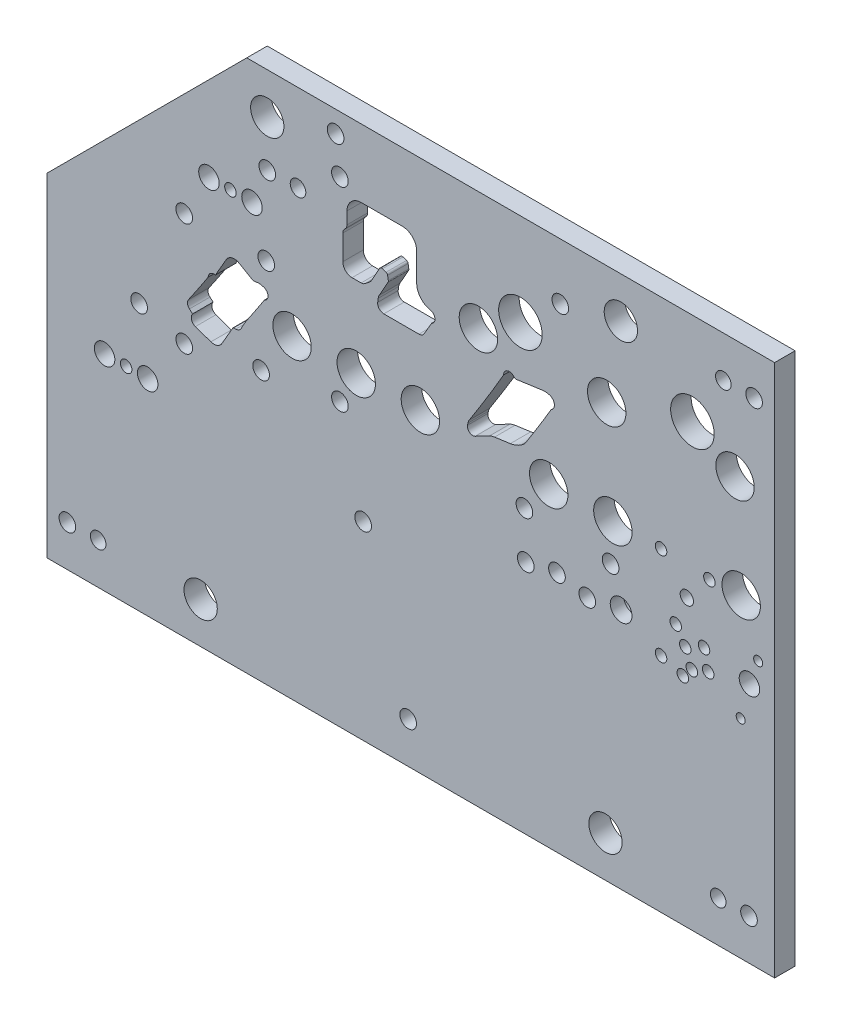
from build123d import *

# Parameters (mm, degrees)
BOSS_EXTRUDE1_DEPTH                            = 12.7
HOLE1_D                                        = 7.14375
HOLE11_D                                       = 7.14375
HOLE12_D                                       = 7.14375
HOLE13_D                                       = 8.2677
HOLE14_D                                       = 7.14375
HOLE15_D                                       = 10.31875
HOLE18_D                                       = 23.8125
HOLE19_D                                       = 26.9875
HOLE110_D                                      = 10.3124
HOLE111_D                                      = 9.652
HOLE112_D                                      = 20.6375
HOLE113_D                                      = 10.3124
HOLE114_D                                      = 10.3124
HOLE115_D                                      = 7.1374
HOLE116_D                                      = 7.1374
HOLE117_D                                      = 12.7
COPY_OF_P250520L_25X1_25_SHSB_10_24_2_D        = 7.1374
COPY_OF_P250520L_25X1_25_SHSB_10_2_2_D         = 12.7
HOLE118_D                                      = 10.3124
HOLE119_D                                      = 10.31875
CUT_EXTRUDE1_QU250515L_PUNCH1_MOUNTED_IN_DEPTH = 1211.017618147
CUT_EXTRUDE1_QU250515L_PUNCH5_MOUNTED_IN_DEPTH = 1211.017618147
CUT_EXTRUDE1_QU250515L_PUNCH4_MOUNTED_IN_DEPTH = 1211.017618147
HOLE120_D                                      = 12.7
HOLE121_D                                      = 5.6134
CUT_EXTRUDE1_DEPTH                             = 1211.017618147


with BuildPart() as part:
    # Sketch1 → Boss-Extrude1 (new body)
    with BuildSketch(Plane.XY):
        Polygon((-1196.34, -180.975), (-745.49, -180.975), (-745.49, 149.225), (-1072.515, 149.225), (-1196.34, 25.4), align=None)
    extrude(amount=BOSS_EXTRUDE1_DEPTH)

    # Hole1 (through all)
    with Locations(Plane(origin=(-798.700521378, -36.640114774, 0), x_dir=(-1, 0, 0), z_dir=(0, 0, -1))):
        with Locations((3.654260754, -10.601140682), (-1.922520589, -4.536872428)):
            Hole(HOLE1_D / 2)

    # Hole11 (through all)
    with Locations(Plane(origin=(-785.566517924, -14.952072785, 0), x_dir=(-1, 0, 0), z_dir=(0, 0, -1))):
        with Locations((3.654260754, -10.601140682)):
            Hole(HOLE11_D / 2)

    # Hole12 (through all)
    with Locations(Plane(origin=(-803.106128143, -11.084921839, 0), x_dir=(-1, 0, 0), z_dir=(0, 0, -1))):
        with Locations((3.654260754, -10.601140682)):
            Hole(HOLE12_D / 2)

    # Hole13 (through all)
    with Locations(Plane(origin=(-803.527406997, 6.49142751, 12.7), x_dir=(1, 0, 0), z_dir=(0, 0, 1))):
        with Locations((3.654260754, -10.601140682)):
            Hole(HOLE13_D / 2)

    # Hole14 (through all)
    with Locations(Plane(origin=(-804.484056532, -20.349265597, 12.7), x_dir=(1, 0, 0), z_dir=(0, 0, 1))):
        with Locations((3.654260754, -10.601140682)):
            Hole(HOLE14_D / 2)

    # Hole15 (through all)
    with Locations(Plane(origin=(-876.677535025, -20.349265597, 0), x_dir=(-1, 0, 0), z_dir=(0, 0, -1))):
        with Locations((3.654260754, -10.601140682)):
            Hole(HOLE15_D / 2)

    # Profil_Sketch7 → Hole17 (revolve, cut)
    with BuildSketch(Plane(origin=(-840.580795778, -30.950406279, 0), x_dir=(0, 1, 0), z_dir=(1, 0, 0))):
        Polygon((0, 12.7), (6.746875, 12.7), (6.746875, 4.445), (10.31875, 4.445), (10.31875, -1), (0, -1), align=None)
    revolve(axis=Axis((-840.580795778, -30.950406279, 0), (0, 0, 1)), mode=Mode.SUBTRACT)

    # Hole18 (through all)
    with Locations(Plane(origin=(-766.346739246, 86.496340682, 0), x_dir=(-1, 0, 0), z_dir=(0, 0, -1))):
        with Locations((3.654260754, -10.601140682), (83.156260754, -10.601140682), (162.658260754, -10.601140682), (278.101260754, -72.526340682), (238.350260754, -72.526340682), (198.599260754, -72.526340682), (119.097260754, -72.526340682), (-0.155739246, -72.526340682), (79.346260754, -72.526340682)):
            Hole(HOLE18_D / 2)

    # Hole19 (through all)
    with Locations(Plane(origin=(-796.896260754, 102.676140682, 12.7), x_dir=(1, 0, 0), z_dir=(0, 0, 1))):
        with Locations((0.479260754, -10.601140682), (-106.073739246, -10.601140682)):
            Hole(HOLE19_D / 2)

    # Hole110 (through all)
    with Locations(Plane(origin=(-761.844260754, 134.426140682, 12.7), x_dir=(1, 0, 0), z_dir=(0, 0, 1))):
        with Locations((3.654260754, -10.601140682), (0.479260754, -290.001140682), (-421.795739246, -290.001140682), (-297.970739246, -39.176140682), (-238.534739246, -197.926140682), (-85.245739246, -143.951140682), (-210.658239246, -290.001140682), (-377.345739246, -150.301140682)):
            Hole(HOLE110_D / 2)

    # Hole111 (through all)
    with Locations(Plane(origin=(-1160.935739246, -144.973859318, 0), x_dir=(-1, 0, 0), z_dir=(0, 0, -1))):
        with Locations((3.654260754, -10.601140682), (-120.170739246, 240.223859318), (-383.695739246, 268.798859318), (-380.520739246, -10.601140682)):
            Hole(HOLE111_D / 2)

    # Hole112 (through all)
    with Locations(Plane(origin=(-1104.744260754, -144.973859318, 12.7), x_dir=(1, 0, 0), z_dir=(0, 0, 1))):
        with Locations((3.654260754, -10.601140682), (44.929260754, 268.798859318), (264.004260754, 268.798859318), (254.479260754, -10.601140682)):
            Hole(HOLE112_D / 2)

    # Hole113 (through all)
    with Locations(Plane(origin=(-904.147760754, 10.601140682, 12.7), x_dir=(1, 0, 0), z_dir=(0, 0, 1))):
        with Locations((3.654260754, -16.951140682), (25.879260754, 103.698859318), (-110.645739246, 103.698859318), (-110.645739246, -16.951140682)):
            Hole(HOLE113_D / 2)

    # Hole114 (through all)
    with Locations(Plane(origin=(-1114.904260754, -12.893859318, 12.7), x_dir=(1, 0, 0), z_dir=(0, 0, 1))):
        with Locations((3.654260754, -10.601140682), (51.279260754, -1.076140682), (54.454260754, 59.248859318), (3.654260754, 59.248859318)):
            Hole(HOLE114_D / 2)

    # Hole115 (through all)
    with Locations(Plane(origin=(-819.502260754, 24.779469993, 12.7), x_dir=(1, 0, 0), z_dir=(0, 0, 1))):
        with Locations((3.654260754, -10.601140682), (33.626260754, -12.235458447), (32.864260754, -61.998940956), (3.654260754, -67.954634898)):
            Hole(HOLE115_D / 2)

    # Hole116 (through all)
    with Locations(Plane(origin=(-1078.957239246, 83.943640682, 0), x_dir=(-1, 0, 0), z_dir=(0, 0, -1))):
        with Locations((3.654260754, -10.601140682)):
            Hole(HOLE116_D / 2)

    # Hole117 (through all)
    with Locations(Plane(origin=(-1092.292239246, 83.943640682, 0), x_dir=(-1, 0, 0), z_dir=(0, 0, -1))):
        with Locations((3.654260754, -10.601140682), (-23.015739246, -10.601140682)):
            Hole(HOLE117_D / 2)

    # Copy of P250520L_.25x1.25-SHSB-_10-24_-2 (through all)
    with Locations(Plane(origin=(-967.260739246, -5.273859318, 0), x_dir=(-1, 0, 0), z_dir=(0, 0, -1))):
        with Locations((179.993760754, -48.383640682)):
            Hole(COPY_OF_P250520L_25X1_25_SHSB_10_24_2_D / 2)

    # Copy of P250520L_.25x1.25-SHSB-_10-2 2 (through all)
    with Locations(Plane(origin=(-980.595739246, -5.273859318, 0), x_dir=(-1, 0, 0), z_dir=(0, 0, -1))):
        with Locations((179.993760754, -48.383640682), (153.323760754, -48.383640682)):
            Hole(COPY_OF_P250520L_25X1_25_SHSB_10_2_2_D / 2)

    # Hole118 (through all)
    with Locations(Plane(origin=(-903.322260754, -24.323859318, 12.7), x_dir=(1, 0, 0), z_dir=(0, 0, 1))):
        with Locations((3.654260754, -10.601140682), (41.754260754, -10.601140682)):
            Hole(HOLE118_D / 2)

    # Hole119 (through all)
    with Locations(Plane(origin=(-1021.114760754, 146.220872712, 12.7), x_dir=(1, 0, 0), z_dir=(0, 0, 1))):
        with Locations((3.654260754, -10.203872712)):
            Hole(HOLE119_D / 2)

    # Sketch1 QU250515L_Punch1_Mounted in the → Cut-Extrude1 QU250515L_Punch1_Mounted in (cut, through all)
    with BuildSketch(Plane.XY.offset(12.7)):
        with BuildLine():
            Line((-935.51885504, 21.734992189), (-935.751135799, 20.476719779))
            ThreePointArc((-935.751135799, 20.476719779), (-934.471170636, 17.22522465), (-930.988165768, 16.943784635))
            Line((-930.988165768, 16.943784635), (-922.238103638, 21.465219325))
            ThreePointArc((-922.238103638, 21.465219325), (-920.656791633, 22.12006258), (-918.987995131, 22.500175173))
            Line((-918.987995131, 22.500175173), (-909.234635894, 23.870920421))
            ThreePointArc((-909.234635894, 23.870920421), (-905.788745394, 24.775733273), (-902.647084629, 26.455856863))
            Line((-902.647084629, 26.455856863), (-901.396409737, 27.326711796))
            ThreePointArc((-901.396409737, 27.326711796), (-900.565080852, 28.035738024), (-899.887615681, 28.892981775))
            ThreePointArc((-899.887615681, 28.892981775), (-891.801194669, 41.735969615), (-883.945669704, 54.721471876))
            ThreePointArc((-883.945669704, 54.721471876), (-882.005925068, 58.94634693), (-885.299663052, 62.227119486))
            Line((-885.299663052, 62.227119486), (-886.984356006, 62.524176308))
            ThreePointArc((-886.984356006, 62.524176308), (-887.877014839, 62.610129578), (-888.772129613, 62.555382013))
            Line((-888.772129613, 62.555382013), (-905.728387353, 60.172335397))
            ThreePointArc((-905.728387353, 60.172335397), (-905.990100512, 60.190271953), (-906.222231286, 60.312463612))
            Line((-906.222231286, 60.312463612), (-907.59056891, 61.447776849))
            ThreePointArc((-907.59056891, 61.447776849), (-911.401119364, 61.905971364), (-913.389561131, 58.623238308))
            ThreePointArc((-913.389561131, 58.623238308), (-923.846383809, 41.058878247), (-934.719730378, 23.749279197))
            ThreePointArc((-934.719730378, 23.749279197), (-935.217870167, 22.781244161), (-935.51885504, 21.734992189))
        make_face()
    extrude(amount=-CUT_EXTRUDE1_QU250515L_PUNCH1_MOUNTED_IN_DEPTH, mode=Mode.SUBTRACT)

    # Sketch1 QU250515L_Punch5_Mounted in the → Cut-Extrude1 QU250515L_Punch5_Mounted in (cut, through all)
    with BuildSketch(Plane.XY.offset(12.7)):
        with BuildLine():
            Line((-1080.596105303, 0.271052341), (-1079.326105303, 0.271052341))
            ThreePointArc((-1079.326105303, 0.271052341), (-1077.304721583, 0.85148459), (-1075.899230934, 2.415930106))
            ThreePointArc((-1075.899230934, 2.415930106), (-1074.231839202, 5.562603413), (-1072.348637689, 8.585069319))
            ThreePointArc((-1072.348637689, 8.585069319), (-1066.936444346, 16.601069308), (-1061.615933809, 24.67821362))
            ThreePointArc((-1061.615933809, 24.67821362), (-1059.336317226, 28.030723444), (-1061.69926627, 31.325028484))
            Line((-1061.69926627, 31.325028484), (-1062.178376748, 31.493898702))
            ThreePointArc((-1062.178376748, 31.493898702), (-1064.528735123, 31.978863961), (-1066.923172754, 31.817481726))
            ThreePointArc((-1066.923172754, 31.817481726), (-1068.298848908, 31.788430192), (-1069.595130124, 32.249931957))
            Line((-1069.595130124, 32.249931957), (-1077.399254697, 36.75564538))
            ThreePointArc((-1077.399254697, 36.75564538), (-1081.73590554, 37.326576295), (-1085.206089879, 34.663810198))
            Line((-1085.206089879, 34.663810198), (-1091.976185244, 22.937661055))
            ThreePointArc((-1091.976185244, 22.937661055), (-1094.992787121, 22.344121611), (-1096.407384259, 19.614452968))
            ThreePointArc((-1096.407384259, 19.614452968), (-1102.451362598, 10.488698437), (-1108.611562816, 1.440991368))
            ThreePointArc((-1108.611562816, 1.440991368), (-1109.21024936, -1.014030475), (-1108.019354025, -3.242780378))
            Line((-1108.019354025, -3.242780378), (-1106.065881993, -4.939232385))
            ThreePointArc((-1106.065881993, -4.939232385), (-1106.720797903, -8.353831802), (-1104.330275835, -10.878472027))
            Line((-1104.330275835, -10.878472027), (-1094.738737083, -14.25916461))
            ThreePointArc((-1094.738737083, -14.25916461), (-1090.85695027, -14.229480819), (-1087.889611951, -11.726671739))
            Line((-1087.889611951, -11.726671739), (-1081.146031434, -0.046447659))
            ThreePointArc((-1081.146031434, -0.046447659), (-1080.913605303, 0.185978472), (-1080.596105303, 0.271052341))
        make_face()
    extrude(amount=-CUT_EXTRUDE1_QU250515L_PUNCH5_MOUNTED_IN_DEPTH, mode=Mode.SUBTRACT)

    # Sketch1 QU250515L_Punch4_Mounted in the → Cut-Extrude1 QU250515L_Punch4_Mounted in (cut, through all)
    with BuildSketch(Plane.XY.offset(12.7)):
        with BuildLine():
            Line((-987.611398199, 54.313461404), (-965.862080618, 54.313461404))
            ThreePointArc((-965.862080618, 54.313461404), (-963.972781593, 54.814889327), (-962.58077773, 56.187188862))
            ThreePointArc((-962.58077773, 56.187188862), (-960.280077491, 60.110039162), (-958.000426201, 64.045158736))
            ThreePointArc((-958.000426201, 64.045158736), (-955.915985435, 67.493037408), (-958.408371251, 70.658597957))
            Line((-958.408371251, 70.658597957), (-960.059437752, 71.166530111))
            ThreePointArc((-960.059437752, 71.166530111), (-965.24445274, 74.84111579), (-967.232, 80.877390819))
            Line((-967.232, 80.877390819), (-967.232, 98.171))
            ThreePointArc((-967.232, 98.171), (-969.835820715, 104.457179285), (-976.122, 107.061))
            Line((-976.122, 107.061), (-1001.522, 107.061))
            ThreePointArc((-1001.522, 107.061), (-1007.808179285, 104.457179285), (-1010.412, 98.171))
            Line((-1010.412, 98.171), (-1010.412, 69.596))
            ThreePointArc((-1010.412, 69.596), (-1008.738115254, 65.554884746), (-1004.697, 63.881))
            Line((-1004.697, 63.881), (-1001.662584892, 63.881))
            ThreePointArc((-1001.662584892, 63.881), (-1000.423283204, 64.088191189), (-999.318770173, 64.687230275))
            Line((-999.318770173, 64.687230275), (-996.692906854, 66.736167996))
            ThreePointArc((-996.692906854, 66.736167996), (-995.901332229, 67.489318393), (-995.271447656, 68.382106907))
            ThreePointArc((-995.271447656, 68.382106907), (-992.732784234, 72.884015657), (-990.221577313, 77.401297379))
            ThreePointArc((-990.221577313, 77.401297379), (-989.475370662, 78.055414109), (-988.48339544, 78.081456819))
            Line((-988.48339544, 78.081456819), (-986.227151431, 77.332525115))
            ThreePointArc((-986.227151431, 77.332525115), (-985.576719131, 76.89483892), (-985.246457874, 76.183812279))
            Line((-985.246457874, 76.183812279), (-984.81086977, 73.535389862))
            ThreePointArc((-984.81086977, 73.535389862), (-984.812967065, 73.049084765), (-984.974668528, 72.590445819))
            ThreePointArc((-984.974668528, 72.590445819), (-987.673879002, 67.759438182), (-990.404271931, 62.94598553))
            ThreePointArc((-990.404271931, 62.94598553), (-990.849834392, 61.952653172), (-991.094334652, 60.891778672))
            Line((-991.094334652, 60.891778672), (-991.389766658, 58.613391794))
            ThreePointArc((-991.389766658, 58.613391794), (-990.473454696, 55.608559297), (-987.611398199, 54.313461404))
        make_face()
    extrude(amount=-CUT_EXTRUDE1_QU250515L_PUNCH4_MOUNTED_IN_DEPTH, mode=Mode.SUBTRACT)

    # Hole120 (through all)
    with Locations(Plane(origin=(-757.424535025, -20.349265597, 0), x_dir=(-1, 0, 0), z_dir=(0, 0, -1))):
        with Locations((3.654260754, -10.601140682)):
            Hole(HOLE120_D / 2)

    # Hole121 (through all)
    with Locations(Plane(origin=(-759.335556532, -8.567732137, 12.7), x_dir=(1, 0, 0), z_dir=(0, 0, 1))):
        with Locations((3.654260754, -7.426140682), (-7.140739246, -43.621140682)):
            Hole(HOLE121_D / 2)

    # Sketch28 → Cut-Extrude1 (cut, through all)
    with BuildSketch(Plane.XY.offset(12.7)):
        with BuildLine():
            Line((-1010.412, 69.596), (-1010.412, 90.694248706))
            ThreePointArc((-1010.412, 90.694248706), (-1010.752330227, 89.120793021), (-1011.71248, 87.828624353))
            ThreePointArc((-1011.71248, 87.828624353), (-1012.672629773, 86.536455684), (-1013.01296, 84.963))
            Line((-1013.01296, 84.963), (-1013.01296, 69.596))
            ThreePointArc((-1013.01296, 69.596), (-1011.339075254, 65.554884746), (-1007.29796, 63.881))
            Line((-1007.29796, 63.881), (-1004.697, 63.881))
            ThreePointArc((-1004.697, 63.881), (-1008.738115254, 65.554884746), (-1010.412, 69.596))
        make_face()
    extrude(amount=-CUT_EXTRUDE1_DEPTH, mode=Mode.SUBTRACT)


solid = part.part
